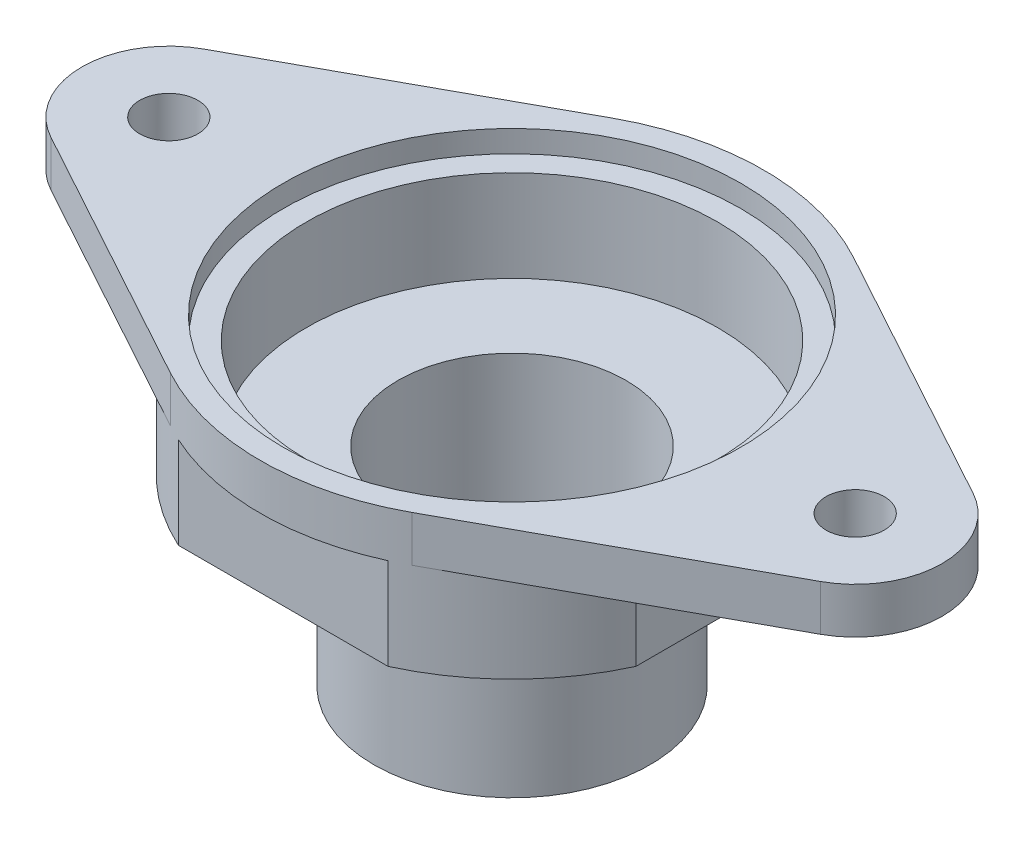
ISO-10303-21;
HEADER;
FILE_DESCRIPTION(('STEP AP214'),'2;1');
FILE_NAME('part.step','',(''),(''),'','','');
FILE_SCHEMA(('AUTOMOTIVE_DESIGN { 1 0 10303 214 1 1 1 1 }'));
ENDSEC;
DATA;
#1=APPLICATION_CONTEXT('core data for automotive mechanical design processes');
#2=APPLICATION_PROTOCOL_DEFINITION('international standard','automotive_design',2000,#1);
#3=PRODUCT_CONTEXT('',#1,'mechanical');
#4=PRODUCT('Part','Part','',(#3));
#5=PRODUCT_RELATED_PRODUCT_CATEGORY('part','',(#4));
#6=PRODUCT_DEFINITION_FORMATION('','',#4);
#7=PRODUCT_DEFINITION_CONTEXT('part definition',#1,'design');
#8=PRODUCT_DEFINITION('design','',#6,#7);
#9=PRODUCT_DEFINITION_SHAPE('','',#8);
#10=(LENGTH_UNIT() NAMED_UNIT(*) SI_UNIT(.MILLI.,.METRE.));
#11=(NAMED_UNIT(*) PLANE_ANGLE_UNIT() SI_UNIT($,.RADIAN.));
#12=(NAMED_UNIT(*) SI_UNIT($,.STERADIAN.) SOLID_ANGLE_UNIT());
#13=UNCERTAINTY_MEASURE_WITH_UNIT(LENGTH_MEASURE(1.E-05),#10,'distance_accuracy_value','');
#14=(GEOMETRIC_REPRESENTATION_CONTEXT(3) GLOBAL_UNCERTAINTY_ASSIGNED_CONTEXT((#13)) GLOBAL_UNIT_ASSIGNED_CONTEXT((#10,
#11,#12)) REPRESENTATION_CONTEXT('',''));
#15=CARTESIAN_POINT('',(0.,0.,0.));
#16=DIRECTION('',(0.,0.,1.));
#17=DIRECTION('',(1.,0.,0.));
#18=AXIS2_PLACEMENT_3D('',#15,#16,#17);
#19=CARTESIAN_POINT('',(5.0419,-3.175,-30.69212215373));
#20=DIRECTION('',(-0.48,0.,-0.877268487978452));
#21=DIRECTION('',(-0.877268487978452,0.,0.48));
#22=AXIS2_PLACEMENT_3D('',#19,#20,#21);
#23=PLANE('',#22);
#24=DIRECTION('',(0.,1.,0.));
#25=VECTOR('',#24,1.);
#26=CARTESIAN_POINT('',(23.368,-3.175,-40.7193009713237));
#27=LINE('',#26,#25);
#28=CARTESIAN_POINT('',(23.368,19.05,-40.7193009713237));
#29=VERTEX_POINT('',#28);
#30=CARTESIAN_POINT('',(23.368,22.225,-40.7193009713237));
#31=VERTEX_POINT('',#30);
#32=EDGE_CURVE('E171',#29,#31,#27,.T.);
#33=ORIENTED_EDGE('',*,*,#32,.F.);
#34=DIRECTION('',(-0.877268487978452,0.,0.48));
#35=VECTOR('',#34,1.);
#36=CARTESIAN_POINT('',(5.0419,19.05,-30.69212215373));
#37=LINE('',#36,#35);
#38=CARTESIAN_POINT('',(5.0419,19.05,-30.69212215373));
#39=VERTEX_POINT('',#38);
#40=EDGE_CURVE('E154',#29,#39,#37,.T.);
#41=ORIENTED_EDGE('',*,*,#40,.T.);
#42=DIRECTION('',(0.,1.,0.));
#43=VECTOR('',#42,1.);
#44=CARTESIAN_POINT('',(5.0419,-3.175,-30.69212215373));
#45=LINE('',#44,#43);
#46=CARTESIAN_POINT('',(5.0419,22.225,-30.69212215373));
#47=VERTEX_POINT('',#46);
#48=EDGE_CURVE('E182',#39,#47,#45,.T.);
#49=ORIENTED_EDGE('',*,*,#48,.T.);
#50=DIRECTION('',(-0.877268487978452,0.,0.48));
#51=VECTOR('',#50,1.);
#52=CARTESIAN_POINT('',(5.0419,22.225,-30.69212215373));
#53=LINE('',#52,#51);
#54=EDGE_CURVE('E180',#31,#47,#53,.T.);
#55=ORIENTED_EDGE('',*,*,#54,.F.);
#56=EDGE_LOOP('',(#33,#41,#49,#55));
#57=FACE_BOUND('',#56,.T.);
#58=ADVANCED_FACE('F40',(#57),#23,.T.);
#59=CARTESIAN_POINT('',(40.132,-3.175,-40.7193009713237));
#60=DIRECTION('',(0.48,0.,-0.877268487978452));
#61=DIRECTION('',(-0.877268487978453,0.,-0.48));
#62=AXIS2_PLACEMENT_3D('',#59,#60,#61);
#63=PLANE('',#62);
#64=DIRECTION('',(-0.877268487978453,0.,-0.48));
#65=VECTOR('',#64,1.);
#66=CARTESIAN_POINT('',(40.132,19.05,-40.7193009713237));
#67=LINE('',#66,#65);
#68=CARTESIAN_POINT('',(58.4581,19.05,-30.69212215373));
#69=VERTEX_POINT('',#68);
#70=CARTESIAN_POINT('',(40.132,19.05,-40.7193009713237));
#71=VERTEX_POINT('',#70);
#72=EDGE_CURVE('E259',#69,#71,#67,.T.);
#73=ORIENTED_EDGE('',*,*,#72,.T.);
#74=DIRECTION('',(0.,1.,0.));
#75=VECTOR('',#74,1.);
#76=CARTESIAN_POINT('',(40.132,-3.175,-40.7193009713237));
#77=LINE('',#76,#75);
#78=CARTESIAN_POINT('',(40.132,22.225,-40.7193009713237));
#79=VERTEX_POINT('',#78);
#80=EDGE_CURVE('E183',#71,#79,#77,.T.);
#81=ORIENTED_EDGE('',*,*,#80,.T.);
#82=DIRECTION('',(-0.877268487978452,0.,-0.48));
#83=VECTOR('',#82,1.);
#84=CARTESIAN_POINT('',(40.132,22.225,-40.7193009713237));
#85=LINE('',#84,#83);
#86=CARTESIAN_POINT('',(58.4581,22.225,-30.69212215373));
#87=VERTEX_POINT('',#86);
#88=EDGE_CURVE('E283',#87,#79,#85,.T.);
#89=ORIENTED_EDGE('',*,*,#88,.F.);
#90=DIRECTION('',(0.,1.,0.));
#91=VECTOR('',#90,1.);
#92=CARTESIAN_POINT('',(58.4581,-3.175,-30.69212215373));
#93=LINE('',#92,#91);
#94=EDGE_CURVE('E187',#69,#87,#93,.T.);
#95=ORIENTED_EDGE('',*,*,#94,.F.);
#96=EDGE_LOOP('',(#73,#81,#89,#95));
#97=FACE_BOUND('',#96,.T.);
#98=ADVANCED_FACE('F295',(#97),#63,.T.);
#99=CARTESIAN_POINT('',(58.4581,-3.175,-20.10787784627));
#100=DIRECTION('',(0.48,0.,0.877268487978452));
#101=DIRECTION('',(0.877268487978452,0.,-0.48));
#102=AXIS2_PLACEMENT_3D('',#99,#100,#101);
#103=PLANE('',#102);
#104=DIRECTION('',(0.,1.,0.));
#105=VECTOR('',#104,1.);
#106=CARTESIAN_POINT('',(40.132,-3.175,-10.0806990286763));
#107=LINE('',#106,#105);
#108=CARTESIAN_POINT('',(40.132,19.05,-10.0806990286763));
#109=VERTEX_POINT('',#108);
#110=CARTESIAN_POINT('',(40.132,22.225,-10.0806990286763));
#111=VERTEX_POINT('',#110);
#112=EDGE_CURVE('E194',#109,#111,#107,.T.);
#113=ORIENTED_EDGE('',*,*,#112,.F.);
#114=DIRECTION('',(0.877268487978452,0.,-0.48));
#115=VECTOR('',#114,1.);
#116=CARTESIAN_POINT('',(58.4581,19.05,-20.10787784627));
#117=LINE('',#116,#115);
#118=CARTESIAN_POINT('',(58.4581,19.05,-20.10787784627));
#119=VERTEX_POINT('',#118);
#120=EDGE_CURVE('E253',#109,#119,#117,.T.);
#121=ORIENTED_EDGE('',*,*,#120,.T.);
#122=DIRECTION('',(0.,1.,0.));
#123=VECTOR('',#122,1.);
#124=CARTESIAN_POINT('',(58.4581,-3.175,-20.10787784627));
#125=LINE('',#124,#123);
#126=CARTESIAN_POINT('',(58.4581,22.225,-20.10787784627));
#127=VERTEX_POINT('',#126);
#128=EDGE_CURVE('E192',#119,#127,#125,.T.);
#129=ORIENTED_EDGE('',*,*,#128,.T.);
#130=DIRECTION('',(0.877268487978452,0.,-0.48));
#131=VECTOR('',#130,1.);
#132=CARTESIAN_POINT('',(58.4581,22.225,-20.10787784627));
#133=LINE('',#132,#131);
#134=EDGE_CURVE('E277',#111,#127,#133,.T.);
#135=ORIENTED_EDGE('',*,*,#134,.F.);
#136=EDGE_LOOP('',(#113,#121,#129,#135));
#137=FACE_BOUND('',#136,.T.);
#138=ADVANCED_FACE('F359',(#137),#103,.T.);
#139=CARTESIAN_POINT('',(5.04190000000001,-3.175,-20.10787784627));
#140=DIRECTION('',(-0.48,0.,0.877268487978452));
#141=DIRECTION('',(0.877268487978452,0.,0.48));
#142=AXIS2_PLACEMENT_3D('',#139,#140,#141);
#143=PLANE('',#142);
#144=DIRECTION('',(0.877268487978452,0.,0.48));
#145=VECTOR('',#144,1.);
#146=CARTESIAN_POINT('',(5.04190000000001,19.05,-20.10787784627));
#147=LINE('',#146,#145);
#148=CARTESIAN_POINT('',(5.04190000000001,19.05,-20.10787784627));
#149=VERTEX_POINT('',#148);
#150=CARTESIAN_POINT('',(23.368,19.05,-10.0806990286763));
#151=VERTEX_POINT('',#150);
#152=EDGE_CURVE('E215',#149,#151,#147,.T.);
#153=ORIENTED_EDGE('',*,*,#152,.T.);
#154=DIRECTION('',(0.,1.,0.));
#155=VECTOR('',#154,1.);
#156=CARTESIAN_POINT('',(23.368,-3.175,-10.0806990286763));
#157=LINE('',#156,#155);
#158=CARTESIAN_POINT('',(23.368,22.225,-10.0806990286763));
#159=VERTEX_POINT('',#158);
#160=EDGE_CURVE('E196',#151,#159,#157,.T.);
#161=ORIENTED_EDGE('',*,*,#160,.T.);
#162=DIRECTION('',(0.877268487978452,0.,0.48));
#163=VECTOR('',#162,1.);
#164=CARTESIAN_POINT('',(5.04190000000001,22.225,-20.10787784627));
#165=LINE('',#164,#163);
#166=CARTESIAN_POINT('',(5.04190000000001,22.225,-20.10787784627));
#167=VERTEX_POINT('',#166);
#168=EDGE_CURVE('E271',#167,#159,#165,.T.);
#169=ORIENTED_EDGE('',*,*,#168,.F.);
#170=DIRECTION('',(0.,1.,0.));
#171=VECTOR('',#170,1.);
#172=CARTESIAN_POINT('',(5.04190000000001,-3.175,-20.10787784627));
#173=LINE('',#172,#171);
#174=EDGE_CURVE('E198',#149,#167,#173,.T.);
#175=ORIENTED_EDGE('',*,*,#174,.F.);
#176=EDGE_LOOP('',(#153,#161,#169,#175));
#177=FACE_BOUND('',#176,.T.);
#178=ADVANCED_FACE('F373',(#177),#143,.T.);
#179=CARTESIAN_POINT('',(15.875,19.05,-9.525));
#180=DIRECTION('',(-1.,0.,0.));
#181=DIRECTION('',(0.,0.,1.));
#182=AXIS2_PLACEMENT_3D('',#179,#180,#181);
#183=PLANE('',#182);
#184=DIRECTION('',(0.,0.,-1.));
#185=VECTOR('',#184,1.);
#186=CARTESIAN_POINT('',(15.875,19.05,-9.525));
#187=LINE('',#186,#185);
#188=CARTESIAN_POINT('',(15.875,19.05,-18.1251610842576));
#189=VERTEX_POINT('',#188);
#190=CARTESIAN_POINT('',(15.875,19.05,-32.6748389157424));
#191=VERTEX_POINT('',#190);
#192=EDGE_CURVE('E239',#189,#191,#187,.T.);
#193=ORIENTED_EDGE('',*,*,#192,.T.);
#194=DIRECTION('',(0.,-1.,0.));
#195=VECTOR('',#194,1.);
#196=CARTESIAN_POINT('',(15.875,88.8982857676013,-32.6748389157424));
#197=LINE('',#196,#195);
#198=CARTESIAN_POINT('',(15.875,12.7,-32.6748389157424));
#199=VERTEX_POINT('',#198);
#200=EDGE_CURVE('E174',#191,#199,#197,.T.);
#201=ORIENTED_EDGE('',*,*,#200,.T.);
#202=DIRECTION('',(0.,0.,1.));
#203=VECTOR('',#202,1.);
#204=CARTESIAN_POINT('',(15.875,12.7,-9.525));
#205=LINE('',#204,#203);
#206=CARTESIAN_POINT('',(15.875,12.7,-18.1251610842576));
#207=VERTEX_POINT('',#206);
#208=EDGE_CURVE('E319',#199,#207,#205,.T.);
#209=ORIENTED_EDGE('',*,*,#208,.T.);
#210=DIRECTION('',(0.,-1.,0.));
#211=VECTOR('',#210,1.);
#212=CARTESIAN_POINT('',(15.875,88.8982857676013,-18.1251610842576));
#213=LINE('',#212,#211);
#214=EDGE_CURVE('E308',#207,#189,#213,.F.);
#215=ORIENTED_EDGE('',*,*,#214,.T.);
#216=EDGE_LOOP('',(#193,#201,#209,#215));
#217=FACE_BOUND('',#216,.T.);
#218=ADVANCED_FACE('F349',(#217),#183,.T.);
#219=CARTESIAN_POINT('',(47.625,19.05,-9.525));
#220=DIRECTION('',(1.,0.,0.));
#221=DIRECTION('',(0.,0.,-1.));
#222=AXIS2_PLACEMENT_3D('',#219,#220,#221);
#223=PLANE('',#222);
#224=DIRECTION('',(0.,0.,1.));
#225=VECTOR('',#224,1.);
#226=CARTESIAN_POINT('',(47.625,19.05,-9.525));
#227=LINE('',#226,#225);
#228=CARTESIAN_POINT('',(47.625,19.05,-32.6748389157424));
#229=VERTEX_POINT('',#228);
#230=CARTESIAN_POINT('',(47.625,19.05,-18.1251610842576));
#231=VERTEX_POINT('',#230);
#232=EDGE_CURVE('E238',#229,#231,#227,.T.);
#233=ORIENTED_EDGE('',*,*,#232,.T.);
#234=DIRECTION('',(0.,-1.,0.));
#235=VECTOR('',#234,1.);
#236=CARTESIAN_POINT('',(47.625,88.8982857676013,-18.1251610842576));
#237=LINE('',#236,#235);
#238=CARTESIAN_POINT('',(47.625,12.7,-18.1251610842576));
#239=VERTEX_POINT('',#238);
#240=EDGE_CURVE('E305',#231,#239,#237,.T.);
#241=ORIENTED_EDGE('',*,*,#240,.T.);
#242=DIRECTION('',(0.,0.,-1.));
#243=VECTOR('',#242,1.);
#244=CARTESIAN_POINT('',(47.625,12.7,-9.525));
#245=LINE('',#244,#243);
#246=CARTESIAN_POINT('',(47.625,12.7,-32.6748389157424));
#247=VERTEX_POINT('',#246);
#248=EDGE_CURVE('E323',#239,#247,#245,.T.);
#249=ORIENTED_EDGE('',*,*,#248,.T.);
#250=DIRECTION('',(0.,-1.,0.));
#251=VECTOR('',#250,1.);
#252=CARTESIAN_POINT('',(47.625,88.8982857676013,-32.6748389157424));
#253=LINE('',#252,#251);
#254=EDGE_CURVE('E175',#247,#229,#253,.F.);
#255=ORIENTED_EDGE('',*,*,#254,.T.);
#256=EDGE_LOOP('',(#233,#241,#249,#255));
#257=FACE_BOUND('',#256,.T.);
#258=ADVANCED_FACE('F339',(#257),#223,.T.);
#259=CARTESIAN_POINT('',(31.75,12.7,-25.4));
#260=DIRECTION('',(0.,-1.,0.));
#261=DIRECTION('',(0.,0.,-1.));
#262=AXIS2_PLACEMENT_3D('',#259,#260,#261);
#263=PLANE('',#262);
#264=CARTESIAN_POINT('',(31.75,12.7,-25.4));
#265=DIRECTION('',(0.,-1.,0.));
#266=DIRECTION('',(0.,0.,-1.));
#267=AXIS2_PLACEMENT_3D('',#264,#265,#266);
#268=CIRCLE('',#267,9.58215);
#269=CARTESIAN_POINT('',(31.75,12.7,-34.98215));
#270=VERTEX_POINT('',#269);
#271=EDGE_CURVE('E313',#270,#270,#268,.T.);
#272=ORIENTED_EDGE('',*,*,#271,.F.);
#273=EDGE_LOOP('',(#272));
#274=FACE_BOUND('',#273,.T.);
#275=CARTESIAN_POINT('',(31.75,12.7,-25.4));
#276=DIRECTION('',(0.,-1.,0.));
#277=DIRECTION('',(0.,0.,-1.));
#278=AXIS2_PLACEMENT_3D('',#275,#276,#277);
#279=CIRCLE('',#278,17.4625);
#280=CARTESIAN_POINT('',(39.0248389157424,12.7,-41.275));
#281=VERTEX_POINT('',#280);
#282=EDGE_CURVE('E55',#247,#281,#279,.F.);
#283=ORIENTED_EDGE('',*,*,#282,.F.);
#284=ORIENTED_EDGE('',*,*,#248,.F.);
#285=CARTESIAN_POINT('',(31.75,12.7,-25.4));
#286=DIRECTION('',(0.,-1.,0.));
#287=DIRECTION('',(0.,0.,-1.));
#288=AXIS2_PLACEMENT_3D('',#285,#286,#287);
#289=CIRCLE('',#288,17.4625);
#290=CARTESIAN_POINT('',(39.0248389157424,12.7,-9.525));
#291=VERTEX_POINT('',#290);
#292=EDGE_CURVE('E324',#291,#239,#289,.F.);
#293=ORIENTED_EDGE('',*,*,#292,.F.);
#294=DIRECTION('',(1.,0.,0.));
#295=VECTOR('',#294,1.);
#296=CARTESIAN_POINT('',(15.875,12.7,-9.525));
#297=LINE('',#296,#295);
#298=CARTESIAN_POINT('',(24.4751610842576,12.7,-9.525));
#299=VERTEX_POINT('',#298);
#300=EDGE_CURVE('E327',#299,#291,#297,.T.);
#301=ORIENTED_EDGE('',*,*,#300,.F.);
#302=EDGE_CURVE('E62',#207,#299,#289,.F.);
#303=ORIENTED_EDGE('',*,*,#302,.F.);
#304=ORIENTED_EDGE('',*,*,#208,.F.);
#305=CARTESIAN_POINT('',(24.4751610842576,12.7,-41.275));
#306=VERTEX_POINT('',#305);
#307=EDGE_CURVE('E227',#306,#199,#279,.F.);
#308=ORIENTED_EDGE('',*,*,#307,.F.);
#309=DIRECTION('',(-1.,0.,0.));
#310=VECTOR('',#309,1.);
#311=CARTESIAN_POINT('',(15.875,12.7,-41.275));
#312=LINE('',#311,#310);
#313=EDGE_CURVE('E12',#281,#306,#312,.T.);
#314=ORIENTED_EDGE('',*,*,#313,.F.);
#315=EDGE_LOOP('',(#283,#284,#293,#301,#303,#304,#308,#314));
#316=FACE_BOUND('',#315,.T.);
#317=ADVANCED_FACE('F340',(#274,#316),#263,.T.);
#318=CARTESIAN_POINT('',(0.,0.,0.));
#319=DIRECTION('',(0.,-1.,0.));
#320=DIRECTION('',(0.,0.,-1.));
#321=AXIS2_PLACEMENT_3D('',#318,#319,#320);
#322=PLANE('',#321);
#323=CARTESIAN_POINT('',(31.75,0.,-25.4));
#324=DIRECTION('',(0.,1.,0.));
#325=DIRECTION('',(0.,0.,1.));
#326=AXIS2_PLACEMENT_3D('',#323,#324,#325);
#327=CIRCLE('',#326,7.91844999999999);
#328=CARTESIAN_POINT('',(31.75,0.,-17.48155));
#329=VERTEX_POINT('',#328);
#330=EDGE_CURVE('E244',#329,#329,#327,.T.);
#331=ORIENTED_EDGE('',*,*,#330,.T.);
#332=EDGE_LOOP('',(#331));
#333=FACE_BOUND('',#332,.T.);
#334=CARTESIAN_POINT('',(31.75,0.,-25.4));
#335=DIRECTION('',(0.,-1.,0.));
#336=DIRECTION('',(0.,0.,-1.));
#337=AXIS2_PLACEMENT_3D('',#334,#335,#336);
#338=CIRCLE('',#337,9.58215);
#339=CARTESIAN_POINT('',(31.75,0.,-34.98215));
#340=VERTEX_POINT('',#339);
#341=EDGE_CURVE('E312',#340,#340,#338,.T.);
#342=ORIENTED_EDGE('',*,*,#341,.T.);
#343=EDGE_LOOP('',(#342));
#344=FACE_BOUND('',#343,.T.);
#345=ADVANCED_FACE('F42',(#333,#344),#322,.T.);
#346=CARTESIAN_POINT('',(31.75,-3.175,-25.4));
#347=DIRECTION('',(0.,1.,0.));
#348=DIRECTION('',(0.,0.,1.));
#349=AXIS2_PLACEMENT_3D('',#346,#347,#348);
#350=CYLINDRICAL_SURFACE('',#349,17.4625);
#351=DIRECTION('',(0.,1.,0.));
#352=VECTOR('',#351,1.);
#353=CARTESIAN_POINT('',(39.0248389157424,-3.175,-41.275));
#354=LINE('',#353,#352);
#355=CARTESIAN_POINT('',(39.0248389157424,19.05,-41.275));
#356=VERTEX_POINT('',#355);
#357=EDGE_CURVE('E224',#281,#356,#354,.T.);
#358=ORIENTED_EDGE('',*,*,#357,.T.);
#359=CARTESIAN_POINT('',(31.75,19.05,-25.4));
#360=DIRECTION('',(0.,-1.,0.));
#361=DIRECTION('',(0.,0.,-1.));
#362=AXIS2_PLACEMENT_3D('',#359,#360,#361);
#363=CIRCLE('',#362,17.4625);
#364=CARTESIAN_POINT('',(24.4751610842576,19.05,-41.275));
#365=VERTEX_POINT('',#364);
#366=EDGE_CURVE('E229',#356,#365,#363,.F.);
#367=ORIENTED_EDGE('',*,*,#366,.T.);
#368=DIRECTION('',(0.,1.,0.));
#369=VECTOR('',#368,1.);
#370=CARTESIAN_POINT('',(24.4751610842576,-3.175,-41.275));
#371=LINE('',#370,#369);
#372=EDGE_CURVE('E48',#365,#306,#371,.F.);
#373=ORIENTED_EDGE('',*,*,#372,.T.);
#374=ORIENTED_EDGE('',*,*,#307,.T.);
#375=ORIENTED_EDGE('',*,*,#200,.F.);
#376=CARTESIAN_POINT('',(31.75,19.05,-25.4));
#377=DIRECTION('',(0.,-1.,0.));
#378=DIRECTION('',(0.,0.,-1.));
#379=AXIS2_PLACEMENT_3D('',#376,#377,#378);
#380=CIRCLE('',#379,17.4625);
#381=EDGE_CURVE('E159',#29,#191,#380,.F.);
#382=ORIENTED_EDGE('',*,*,#381,.F.);
#383=ORIENTED_EDGE('',*,*,#32,.T.);
#384=CARTESIAN_POINT('',(31.75,22.225,-25.4));
#385=DIRECTION('',(0.,1.,0.));
#386=DIRECTION('',(0.,0.,1.));
#387=AXIS2_PLACEMENT_3D('',#384,#385,#386);
#388=CIRCLE('',#387,17.4625);
#389=EDGE_CURVE('E286',#79,#31,#388,.T.);
#390=ORIENTED_EDGE('',*,*,#389,.F.);
#391=ORIENTED_EDGE('',*,*,#80,.F.);
#392=EDGE_CURVE('E178',#229,#71,#380,.F.);
#393=ORIENTED_EDGE('',*,*,#392,.F.);
#394=ORIENTED_EDGE('',*,*,#254,.F.);
#395=ORIENTED_EDGE('',*,*,#282,.T.);
#396=EDGE_LOOP('',(#358,#367,#373,#374,#375,#382,#383,#390,#391,#393,#394,#395));
#397=FACE_BOUND('',#396,.T.);
#398=ADVANCED_FACE('F169',(#397),#350,.T.);
#399=CARTESIAN_POINT('',(31.75,-3.175,-25.4));
#400=DIRECTION('',(0.,1.,0.));
#401=DIRECTION('',(0.,0.,1.));
#402=AXIS2_PLACEMENT_3D('',#399,#400,#401);
#403=CYLINDRICAL_SURFACE('',#402,17.4625);
#404=ORIENTED_EDGE('',*,*,#292,.T.);
#405=ORIENTED_EDGE('',*,*,#240,.F.);
#406=EDGE_CURVE('E302',#109,#231,#380,.F.);
#407=ORIENTED_EDGE('',*,*,#406,.F.);
#408=ORIENTED_EDGE('',*,*,#112,.T.);
#409=CARTESIAN_POINT('',(31.75,22.225,-25.4));
#410=DIRECTION('',(0.,1.,0.));
#411=DIRECTION('',(0.,0.,1.));
#412=AXIS2_PLACEMENT_3D('',#409,#410,#411);
#413=CIRCLE('',#412,17.4625);
#414=EDGE_CURVE('E274',#159,#111,#413,.T.);
#415=ORIENTED_EDGE('',*,*,#414,.F.);
#416=ORIENTED_EDGE('',*,*,#160,.F.);
#417=EDGE_CURVE('E176',#189,#151,#380,.F.);
#418=ORIENTED_EDGE('',*,*,#417,.F.);
#419=ORIENTED_EDGE('',*,*,#214,.F.);
#420=ORIENTED_EDGE('',*,*,#302,.T.);
#421=DIRECTION('',(0.,1.,0.));
#422=VECTOR('',#421,1.);
#423=CARTESIAN_POINT('',(24.4751610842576,-3.175,-9.52500000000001));
#424=LINE('',#423,#422);
#425=CARTESIAN_POINT('',(24.4751610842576,19.05,-9.52500000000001));
#426=VERTEX_POINT('',#425);
#427=EDGE_CURVE('E219',#299,#426,#424,.T.);
#428=ORIENTED_EDGE('',*,*,#427,.T.);
#429=CARTESIAN_POINT('',(31.75,19.05,-25.4));
#430=DIRECTION('',(0.,-1.,0.));
#431=DIRECTION('',(0.,0.,-1.));
#432=AXIS2_PLACEMENT_3D('',#429,#430,#431);
#433=CIRCLE('',#432,17.4625);
#434=CARTESIAN_POINT('',(39.0248389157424,19.05,-9.525));
#435=VERTEX_POINT('',#434);
#436=EDGE_CURVE('E166',#426,#435,#433,.F.);
#437=ORIENTED_EDGE('',*,*,#436,.T.);
#438=DIRECTION('',(0.,1.,0.));
#439=VECTOR('',#438,1.);
#440=CARTESIAN_POINT('',(39.0248389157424,-3.175,-9.52500000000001));
#441=LINE('',#440,#439);
#442=EDGE_CURVE('E221',#435,#291,#441,.F.);
#443=ORIENTED_EDGE('',*,*,#442,.T.);
#444=EDGE_LOOP('',(#404,#405,#407,#408,#415,#416,#418,#419,#420,#428,#437,#443));
#445=FACE_BOUND('',#444,.T.);
#446=ADVANCED_FACE('F336',(#445),#403,.T.);
#447=CARTESIAN_POINT('',(15.875,19.05,-9.525));
#448=DIRECTION('',(0.,0.,1.));
#449=DIRECTION('',(1.,0.,0.));
#450=AXIS2_PLACEMENT_3D('',#447,#448,#449);
#451=PLANE('',#450);
#452=ORIENTED_EDGE('',*,*,#427,.F.);
#453=ORIENTED_EDGE('',*,*,#300,.T.);
#454=ORIENTED_EDGE('',*,*,#442,.F.);
#455=DIRECTION('',(-1.,0.,0.));
#456=VECTOR('',#455,1.);
#457=CARTESIAN_POINT('',(15.875,19.05,-9.525));
#458=LINE('',#457,#456);
#459=EDGE_CURVE('E242',#435,#426,#458,.T.);
#460=ORIENTED_EDGE('',*,*,#459,.T.);
#461=EDGE_LOOP('',(#452,#453,#454,#460));
#462=FACE_BOUND('',#461,.T.);
#463=ADVANCED_FACE('F377',(#462),#451,.T.);
#464=CARTESIAN_POINT('',(15.875,19.05,-41.275));
#465=DIRECTION('',(0.,0.,-1.));
#466=DIRECTION('',(-1.,0.,0.));
#467=AXIS2_PLACEMENT_3D('',#464,#465,#466);
#468=PLANE('',#467);
#469=ORIENTED_EDGE('',*,*,#357,.F.);
#470=ORIENTED_EDGE('',*,*,#313,.T.);
#471=ORIENTED_EDGE('',*,*,#372,.F.);
#472=DIRECTION('',(1.,0.,0.));
#473=VECTOR('',#472,1.);
#474=CARTESIAN_POINT('',(15.875,19.05,-41.275));
#475=LINE('',#474,#473);
#476=EDGE_CURVE('E235',#365,#356,#475,.T.);
#477=ORIENTED_EDGE('',*,*,#476,.T.);
#478=EDGE_LOOP('',(#469,#470,#471,#477));
#479=FACE_BOUND('',#478,.T.);
#480=ADVANCED_FACE('F234',(#479),#468,.T.);
#481=CARTESIAN_POINT('',(55.5625,22.225,-25.4));
#482=DIRECTION('',(0.,1.,0.));
#483=DIRECTION('',(0.,0.,1.));
#484=AXIS2_PLACEMENT_3D('',#481,#482,#483);
#485=CYLINDRICAL_SURFACE('',#484,2.01929999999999);
#486=CARTESIAN_POINT('',(55.5625,22.225,-25.4));
#487=DIRECTION('',(0.,1.,0.));
#488=DIRECTION('',(0.,0.,1.));
#489=AXIS2_PLACEMENT_3D('',#486,#487,#488);
#490=CIRCLE('',#489,2.01929999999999);
#491=CARTESIAN_POINT('',(55.5625,22.225,-23.3807));
#492=VERTEX_POINT('',#491);
#493=EDGE_CURVE('E202',#492,#492,#490,.T.);
#494=ORIENTED_EDGE('',*,*,#493,.T.);
#495=EDGE_LOOP('',(#494));
#496=FACE_BOUND('',#495,.T.);
#497=CARTESIAN_POINT('',(55.5625,19.05,-25.4));
#498=DIRECTION('',(0.,-1.,0.));
#499=DIRECTION('',(0.,0.,-1.));
#500=AXIS2_PLACEMENT_3D('',#497,#498,#499);
#501=CIRCLE('',#500,2.01929999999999);
#502=CARTESIAN_POINT('',(55.5625,19.05,-27.4193));
#503=VERTEX_POINT('',#502);
#504=EDGE_CURVE('E265',#503,#503,#501,.F.);
#505=ORIENTED_EDGE('',*,*,#504,.F.);
#506=EDGE_LOOP('',(#505));
#507=FACE_BOUND('',#506,.T.);
#508=ADVANCED_FACE('F387',(#496,#507),#485,.F.);
#509=CARTESIAN_POINT('',(7.93750000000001,22.225,-25.4));
#510=DIRECTION('',(0.,1.,0.));
#511=DIRECTION('',(0.,0.,1.));
#512=AXIS2_PLACEMENT_3D('',#509,#510,#511);
#513=CYLINDRICAL_SURFACE('',#512,2.01929999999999);
#514=CARTESIAN_POINT('',(7.93750000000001,22.225,-25.4));
#515=DIRECTION('',(0.,1.,0.));
#516=DIRECTION('',(0.,0.,1.));
#517=AXIS2_PLACEMENT_3D('',#514,#515,#516);
#518=CIRCLE('',#517,2.01929999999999);
#519=CARTESIAN_POINT('',(7.93750000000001,22.225,-23.3807));
#520=VERTEX_POINT('',#519);
#521=EDGE_CURVE('E185',#520,#520,#518,.T.);
#522=ORIENTED_EDGE('',*,*,#521,.T.);
#523=EDGE_LOOP('',(#522));
#524=FACE_BOUND('',#523,.T.);
#525=CARTESIAN_POINT('',(7.93750000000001,19.05,-25.4));
#526=DIRECTION('',(0.,-1.,0.));
#527=DIRECTION('',(0.,0.,-1.));
#528=AXIS2_PLACEMENT_3D('',#525,#526,#527);
#529=CIRCLE('',#528,2.01929999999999);
#530=CARTESIAN_POINT('',(7.93750000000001,19.05,-27.4193));
#531=VERTEX_POINT('',#530);
#532=EDGE_CURVE('E262',#531,#531,#529,.F.);
#533=ORIENTED_EDGE('',*,*,#532,.F.);
#534=EDGE_LOOP('',(#533));
#535=FACE_BOUND('',#534,.T.);
#536=ADVANCED_FACE('F383',(#524,#535),#513,.F.);
#537=CARTESIAN_POINT('',(7.93750000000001,-3.175,-25.4));
#538=DIRECTION('',(0.,1.,0.));
#539=DIRECTION('',(0.,0.,1.));
#540=AXIS2_PLACEMENT_3D('',#537,#538,#539);
#541=CYLINDRICAL_SURFACE('',#540,6.03250000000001);
#542=ORIENTED_EDGE('',*,*,#48,.F.);
#543=CARTESIAN_POINT('',(7.93750000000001,19.05,-25.4));
#544=DIRECTION('',(0.,-1.,0.));
#545=DIRECTION('',(0.,0.,-1.));
#546=AXIS2_PLACEMENT_3D('',#543,#544,#545);
#547=CIRCLE('',#546,6.03250000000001);
#548=EDGE_CURVE('E162',#39,#149,#547,.F.);
#549=ORIENTED_EDGE('',*,*,#548,.T.);
#550=ORIENTED_EDGE('',*,*,#174,.T.);
#551=CARTESIAN_POINT('',(7.93750000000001,22.225,-25.4));
#552=DIRECTION('',(0.,1.,0.));
#553=DIRECTION('',(0.,0.,1.));
#554=AXIS2_PLACEMENT_3D('',#551,#552,#553);
#555=CIRCLE('',#554,6.03250000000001);
#556=EDGE_CURVE('E268',#47,#167,#555,.T.);
#557=ORIENTED_EDGE('',*,*,#556,.F.);
#558=EDGE_LOOP('',(#542,#549,#550,#557));
#559=FACE_BOUND('',#558,.T.);
#560=ADVANCED_FACE('F369',(#559),#541,.T.);
#561=CARTESIAN_POINT('',(55.5625,-3.175,-25.4));
#562=DIRECTION('',(0.,1.,0.));
#563=DIRECTION('',(0.,0.,1.));
#564=AXIS2_PLACEMENT_3D('',#561,#562,#563);
#565=CYLINDRICAL_SURFACE('',#564,6.0325);
#566=ORIENTED_EDGE('',*,*,#128,.F.);
#567=CARTESIAN_POINT('',(55.5625,19.05,-25.4));
#568=DIRECTION('',(0.,-1.,0.));
#569=DIRECTION('',(0.,0.,-1.));
#570=AXIS2_PLACEMENT_3D('',#567,#568,#569);
#571=CIRCLE('',#570,6.0325);
#572=EDGE_CURVE('E256',#119,#69,#571,.F.);
#573=ORIENTED_EDGE('',*,*,#572,.T.);
#574=ORIENTED_EDGE('',*,*,#94,.T.);
#575=CARTESIAN_POINT('',(55.5625,22.225,-25.4));
#576=DIRECTION('',(0.,1.,0.));
#577=DIRECTION('',(0.,0.,1.));
#578=AXIS2_PLACEMENT_3D('',#575,#576,#577);
#579=CIRCLE('',#578,6.0325);
#580=EDGE_CURVE('E280',#127,#87,#579,.T.);
#581=ORIENTED_EDGE('',*,*,#580,.F.);
#582=EDGE_LOOP('',(#566,#573,#574,#581));
#583=FACE_BOUND('',#582,.T.);
#584=ADVANCED_FACE('F366',(#583),#565,.T.);
#585=CARTESIAN_POINT('',(0.,22.225,0.));
#586=DIRECTION('',(0.,-1.,0.));
#587=DIRECTION('',(0.,0.,-1.));
#588=AXIS2_PLACEMENT_3D('',#585,#586,#587);
#589=PLANE('',#588);
#590=CARTESIAN_POINT('',(31.75,22.225,-25.4));
#591=DIRECTION('',(0.,1.,0.));
#592=DIRECTION('',(0.,0.,1.));
#593=AXIS2_PLACEMENT_3D('',#590,#591,#592);
#594=CIRCLE('',#593,15.875);
#595=CARTESIAN_POINT('',(31.75,22.225,-9.525));
#596=VERTEX_POINT('',#595);
#597=EDGE_CURVE('E205',#596,#596,#594,.T.);
#598=ORIENTED_EDGE('',*,*,#597,.F.);
#599=EDGE_LOOP('',(#598));
#600=FACE_BOUND('',#599,.T.);
#601=ORIENTED_EDGE('',*,*,#493,.F.);
#602=EDGE_LOOP('',(#601));
#603=FACE_BOUND('',#602,.T.);
#604=ORIENTED_EDGE('',*,*,#521,.F.);
#605=EDGE_LOOP('',(#604));
#606=FACE_BOUND('',#605,.T.);
#607=ORIENTED_EDGE('',*,*,#556,.T.);
#608=ORIENTED_EDGE('',*,*,#168,.T.);
#609=ORIENTED_EDGE('',*,*,#414,.T.);
#610=ORIENTED_EDGE('',*,*,#134,.T.);
#611=ORIENTED_EDGE('',*,*,#580,.T.);
#612=ORIENTED_EDGE('',*,*,#88,.T.);
#613=ORIENTED_EDGE('',*,*,#389,.T.);
#614=ORIENTED_EDGE('',*,*,#54,.T.);
#615=EDGE_LOOP('',(#607,#608,#609,#610,#611,#612,#613,#614));
#616=FACE_BOUND('',#615,.T.);
#617=ADVANCED_FACE('F288',(#600,#603,#606,#616),#589,.F.);
#618=CARTESIAN_POINT('',(31.75,20.701,-25.4));
#619=DIRECTION('',(0.,1.,0.));
#620=DIRECTION('',(0.,0.,1.));
#621=AXIS2_PLACEMENT_3D('',#618,#619,#620);
#622=PLANE('',#621);
#623=CARTESIAN_POINT('',(31.75,20.701,-25.4));
#624=DIRECTION('',(0.,1.,0.));
#625=DIRECTION('',(0.,0.,1.));
#626=AXIS2_PLACEMENT_3D('',#623,#624,#625);
#627=CIRCLE('',#626,15.875);
#628=CARTESIAN_POINT('',(31.75,20.701,-9.525));
#629=VERTEX_POINT('',#628);
#630=EDGE_CURVE('E206',#629,#629,#627,.T.);
#631=ORIENTED_EDGE('',*,*,#630,.T.);
#632=EDGE_LOOP('',(#631));
#633=FACE_BOUND('',#632,.T.);
#634=CARTESIAN_POINT('',(31.75,20.701,-25.4));
#635=DIRECTION('',(0.,1.,0.));
#636=DIRECTION('',(0.,0.,1.));
#637=AXIS2_PLACEMENT_3D('',#634,#635,#636);
#638=CIRCLE('',#637,14.26845);
#639=CARTESIAN_POINT('',(31.75,20.701,-11.13155));
#640=VERTEX_POINT('',#639);
#641=EDGE_CURVE('E209',#640,#640,#638,.F.);
#642=ORIENTED_EDGE('',*,*,#641,.T.);
#643=EDGE_LOOP('',(#642));
#644=FACE_BOUND('',#643,.T.);
#645=ADVANCED_FACE('F392',(#633,#644),#622,.T.);
#646=CARTESIAN_POINT('',(31.75,20.701,-25.4));
#647=DIRECTION('',(0.,1.,0.));
#648=DIRECTION('',(0.,0.,1.));
#649=AXIS2_PLACEMENT_3D('',#646,#647,#648);
#650=CYLINDRICAL_SURFACE('',#649,15.875);
#651=CARTESIAN_POINT('',(31.75,20.701,-9.525));
#652=CARTESIAN_POINT('',(31.75,20.716875,-9.525));
#653=CARTESIAN_POINT('',(31.75,20.73275,-9.525));
#654=CARTESIAN_POINT('',(31.75,20.7645,-9.525));
#655=CARTESIAN_POINT('',(31.75,20.780375,-9.525));
#656=CARTESIAN_POINT('',(31.75,20.812125,-9.525));
#657=CARTESIAN_POINT('',(31.75,20.828,-9.525));
#658=CARTESIAN_POINT('',(31.75,20.85975,-9.525));
#659=CARTESIAN_POINT('',(31.75,20.875625,-9.525));
#660=CARTESIAN_POINT('',(31.75,20.907375,-9.525));
#661=CARTESIAN_POINT('',(31.75,20.92325,-9.525));
#662=CARTESIAN_POINT('',(31.75,20.955,-9.525));
#663=CARTESIAN_POINT('',(31.75,20.970875,-9.525));
#664=CARTESIAN_POINT('',(31.75,21.002625,-9.525));
#665=CARTESIAN_POINT('',(31.75,21.0185,-9.525));
#666=CARTESIAN_POINT('',(31.75,21.05025,-9.525));
#667=CARTESIAN_POINT('',(31.75,21.066125,-9.525));
#668=CARTESIAN_POINT('',(31.75,21.097875,-9.525));
#669=CARTESIAN_POINT('',(31.75,21.11375,-9.525));
#670=CARTESIAN_POINT('',(31.75,21.1455,-9.525));
#671=CARTESIAN_POINT('',(31.75,21.161375,-9.525));
#672=CARTESIAN_POINT('',(31.75,21.193125,-9.525));
#673=CARTESIAN_POINT('',(31.75,21.209,-9.525));
#674=CARTESIAN_POINT('',(31.75,21.24075,-9.525));
#675=CARTESIAN_POINT('',(31.75,21.256625,-9.525));
#676=CARTESIAN_POINT('',(31.75,21.288375,-9.525));
#677=CARTESIAN_POINT('',(31.75,21.30425,-9.525));
#678=CARTESIAN_POINT('',(31.75,21.336,-9.525));
#679=CARTESIAN_POINT('',(31.75,21.351875,-9.525));
#680=CARTESIAN_POINT('',(31.75,21.383625,-9.525));
#681=CARTESIAN_POINT('',(31.75,21.3995,-9.525));
#682=CARTESIAN_POINT('',(31.75,21.43125,-9.525));
#683=CARTESIAN_POINT('',(31.75,21.447125,-9.525));
#684=CARTESIAN_POINT('',(31.75,21.478875,-9.525));
#685=CARTESIAN_POINT('',(31.75,21.49475,-9.525));
#686=CARTESIAN_POINT('',(31.75,21.5265,-9.525));
#687=CARTESIAN_POINT('',(31.75,21.542375,-9.525));
#688=CARTESIAN_POINT('',(31.75,21.574125,-9.525));
#689=CARTESIAN_POINT('',(31.75,21.59,-9.525));
#690=CARTESIAN_POINT('',(31.75,21.62175,-9.525));
#691=CARTESIAN_POINT('',(31.75,21.637625,-9.525));
#692=CARTESIAN_POINT('',(31.75,21.669375,-9.525));
#693=CARTESIAN_POINT('',(31.75,21.68525,-9.525));
#694=CARTESIAN_POINT('',(31.75,21.717,-9.525));
#695=CARTESIAN_POINT('',(31.75,21.732875,-9.525));
#696=CARTESIAN_POINT('',(31.75,21.764625,-9.525));
#697=CARTESIAN_POINT('',(31.75,21.7805,-9.525));
#698=CARTESIAN_POINT('',(31.75,21.81225,-9.525));
#699=CARTESIAN_POINT('',(31.75,21.828125,-9.525));
#700=CARTESIAN_POINT('',(31.75,21.859875,-9.525));
#701=CARTESIAN_POINT('',(31.75,21.87575,-9.525));
#702=CARTESIAN_POINT('',(31.75,21.9075,-9.525));
#703=CARTESIAN_POINT('',(31.75,21.923375,-9.525));
#704=CARTESIAN_POINT('',(31.75,21.955125,-9.525));
#705=CARTESIAN_POINT('',(31.75,21.971,-9.525));
#706=CARTESIAN_POINT('',(31.75,22.00275,-9.525));
#707=CARTESIAN_POINT('',(31.75,22.018625,-9.525));
#708=CARTESIAN_POINT('',(31.75,22.050375,-9.525));
#709=CARTESIAN_POINT('',(31.75,22.06625,-9.525));
#710=CARTESIAN_POINT('',(31.75,22.098,-9.525));
#711=CARTESIAN_POINT('',(31.75,22.113875,-9.525));
#712=CARTESIAN_POINT('',(31.75,22.145625,-9.525));
#713=CARTESIAN_POINT('',(31.75,22.1615,-9.525));
#714=CARTESIAN_POINT('',(31.75,22.19325,-9.525));
#715=CARTESIAN_POINT('',(31.75,22.209125,-9.525));
#716=CARTESIAN_POINT('',(31.75,22.225,-9.525));
#717=B_SPLINE_CURVE_WITH_KNOTS('',3,(#651,#652,#653,#654,#655,#656,#657,#658,#659,#660,#661,
#662,#663,#664,#665,#666,#667,#668,#669,#670,#671,#672,#673,#674,#675,#676,#677,#678,#679,#680,
#681,#682,#683,#684,#685,#686,#687,#688,#689,#690,#691,#692,#693,#694,#695,#696,#697,#698,#699,
#700,#701,#702,#703,#704,#705,#706,#707,#708,#709,#710,#711,#712,#713,#714,#715,#716),
.UNSPECIFIED.,.F.,.F.,(4,2,2,2,2,2,2,2,2,2,2,2,2,2,2,2,2,2,2,2,2,2,2,2,2,2,2,2,2,2,2,2,4),(0.,
0.0476249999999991,0.0952499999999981,0.142874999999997,0.1905,0.238124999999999,
0.285749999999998,0.333374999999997,0.380999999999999,0.428624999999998,0.476249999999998,
0.523875,0.571499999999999,0.619124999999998,0.666749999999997,0.714375,0.761999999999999,
0.809624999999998,0.85725,0.904874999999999,0.952499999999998,1.000125,1.04775,1.095375,1.143,
1.190625,1.23825,1.285875,1.3335,1.381125,1.42875,1.476375,1.524),.UNSPECIFIED.);
#718=EDGE_CURVE('BSEAM395',#629,#596,#717,.T.);
#719=ORIENTED_EDGE('',*,*,#630,.F.);
#720=ORIENTED_EDGE('',*,*,#597,.T.);
#721=ORIENTED_EDGE('',*,*,#718,.T.);
#722=ORIENTED_EDGE('',*,*,#718,.F.);
#723=EDGE_LOOP('',(#719,#721,#720,#722));
#724=FACE_BOUND('',#723,.T.);
#725=ADVANCED_FACE('F395',(#724),#650,.F.);
#726=CARTESIAN_POINT('',(31.75,14.351,-25.4));
#727=DIRECTION('',(0.,1.,0.));
#728=DIRECTION('',(0.,0.,1.));
#729=AXIS2_PLACEMENT_3D('',#726,#727,#728);
#730=PLANE('',#729);
#731=CARTESIAN_POINT('',(31.75,14.351,-25.4));
#732=DIRECTION('',(0.,1.,0.));
#733=DIRECTION('',(0.,0.,1.));
#734=AXIS2_PLACEMENT_3D('',#731,#732,#733);
#735=CIRCLE('',#734,7.91844999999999);
#736=CARTESIAN_POINT('',(31.75,14.351,-17.48155));
#737=VERTEX_POINT('',#736);
#738=EDGE_CURVE('E331',#737,#737,#735,.T.);
#739=ORIENTED_EDGE('',*,*,#738,.F.);
#740=EDGE_LOOP('',(#739));
#741=FACE_BOUND('',#740,.T.);
#742=CARTESIAN_POINT('',(31.75,14.351,-25.4));
#743=DIRECTION('',(0.,1.,0.));
#744=DIRECTION('',(0.,0.,1.));
#745=AXIS2_PLACEMENT_3D('',#742,#743,#744);
#746=CIRCLE('',#745,14.26845);
#747=CARTESIAN_POINT('',(31.75,14.351,-11.13155));
#748=VERTEX_POINT('',#747);
#749=EDGE_CURVE('E212',#748,#748,#746,.T.);
#750=ORIENTED_EDGE('',*,*,#749,.T.);
#751=EDGE_LOOP('',(#750));
#752=FACE_BOUND('',#751,.T.);
#753=ADVANCED_FACE('F399',(#741,#752),#730,.T.);
#754=CARTESIAN_POINT('',(31.75,14.351,-25.4));
#755=DIRECTION('',(0.,1.,0.));
#756=DIRECTION('',(0.,0.,1.));
#757=AXIS2_PLACEMENT_3D('',#754,#755,#756);
#758=CYLINDRICAL_SURFACE('',#757,14.26845);
#759=ORIENTED_EDGE('',*,*,#749,.F.);
#760=EDGE_LOOP('',(#759));
#761=FACE_BOUND('',#760,.T.);
#762=ORIENTED_EDGE('',*,*,#641,.F.);
#763=EDGE_LOOP('',(#762));
#764=FACE_BOUND('',#763,.T.);
#765=ADVANCED_FACE('F403',(#761,#764),#758,.F.);
#766=CARTESIAN_POINT('',(31.75,19.05,-25.4));
#767=DIRECTION('',(0.,-1.,0.));
#768=DIRECTION('',(0.,0.,-1.));
#769=AXIS2_PLACEMENT_3D('',#766,#767,#768);
#770=PLANE('',#769);
#771=ORIENTED_EDGE('',*,*,#40,.F.);
#772=ORIENTED_EDGE('',*,*,#381,.T.);
#773=ORIENTED_EDGE('',*,*,#192,.F.);
#774=ORIENTED_EDGE('',*,*,#417,.T.);
#775=ORIENTED_EDGE('',*,*,#152,.F.);
#776=ORIENTED_EDGE('',*,*,#548,.F.);
#777=EDGE_LOOP('',(#771,#772,#773,#774,#775,#776));
#778=FACE_BOUND('',#777,.T.);
#779=ORIENTED_EDGE('',*,*,#532,.T.);
#780=EDGE_LOOP('',(#779));
#781=FACE_BOUND('',#780,.T.);
#782=ADVANCED_FACE('F156',(#778,#781),#770,.T.);
#783=ORIENTED_EDGE('',*,*,#459,.F.);
#784=ORIENTED_EDGE('',*,*,#436,.F.);
#785=EDGE_LOOP('',(#783,#784));
#786=FACE_BOUND('',#785,.T.);
#787=ADVANCED_FACE('F419',(#786),#770,.T.);
#788=ORIENTED_EDGE('',*,*,#120,.F.);
#789=ORIENTED_EDGE('',*,*,#406,.T.);
#790=ORIENTED_EDGE('',*,*,#232,.F.);
#791=ORIENTED_EDGE('',*,*,#392,.T.);
#792=ORIENTED_EDGE('',*,*,#72,.F.);
#793=ORIENTED_EDGE('',*,*,#572,.F.);
#794=EDGE_LOOP('',(#788,#789,#790,#791,#792,#793));
#795=FACE_BOUND('',#794,.T.);
#796=ORIENTED_EDGE('',*,*,#504,.T.);
#797=EDGE_LOOP('',(#796));
#798=FACE_BOUND('',#797,.T.);
#799=ADVANCED_FACE('F299',(#795,#798),#770,.T.);
#800=ORIENTED_EDGE('',*,*,#476,.F.);
#801=ORIENTED_EDGE('',*,*,#366,.F.);
#802=EDGE_LOOP('',(#800,#801));
#803=FACE_BOUND('',#802,.T.);
#804=ADVANCED_FACE('F237',(#803),#770,.T.);
#805=CARTESIAN_POINT('',(31.75,0.,-25.4));
#806=DIRECTION('',(0.,1.,0.));
#807=DIRECTION('',(0.,0.,1.));
#808=AXIS2_PLACEMENT_3D('',#805,#806,#807);
#809=CYLINDRICAL_SURFACE('',#808,7.91844999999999);
#810=ORIENTED_EDGE('',*,*,#330,.F.);
#811=EDGE_LOOP('',(#810));
#812=FACE_BOUND('',#811,.T.);
#813=ORIENTED_EDGE('',*,*,#738,.T.);
#814=EDGE_LOOP('',(#813));
#815=FACE_BOUND('',#814,.T.);
#816=ADVANCED_FACE('F425',(#812,#815),#809,.F.);
#817=CARTESIAN_POINT('',(31.75,12.7,-25.4));
#818=DIRECTION('',(0.,-1.,0.));
#819=DIRECTION('',(0.,0.,-1.));
#820=AXIS2_PLACEMENT_3D('',#817,#818,#819);
#821=CYLINDRICAL_SURFACE('',#820,9.58215);
#822=ORIENTED_EDGE('',*,*,#271,.T.);
#823=EDGE_LOOP('',(#822));
#824=FACE_BOUND('',#823,.T.);
#825=ORIENTED_EDGE('',*,*,#341,.F.);
#826=EDGE_LOOP('',(#825));
#827=FACE_BOUND('',#826,.T.);
#828=ADVANCED_FACE('F442',(#824,#827),#821,.T.);
#829=CLOSED_SHELL('',(#58,#98,#138,#178,#218,#258,#317,#345,#398,#446,#463,#480,#508,#536,#560,
#584,#617,#645,#725,#753,#765,#782,#787,#799,#804,#816,#828));
#830=MANIFOLD_SOLID_BREP('B2',#829);
#831=ADVANCED_BREP_SHAPE_REPRESENTATION('',(#18,#830),#14);
#832=SHAPE_DEFINITION_REPRESENTATION(#9,#831);
ENDSEC;
END-ISO-10303-21;
